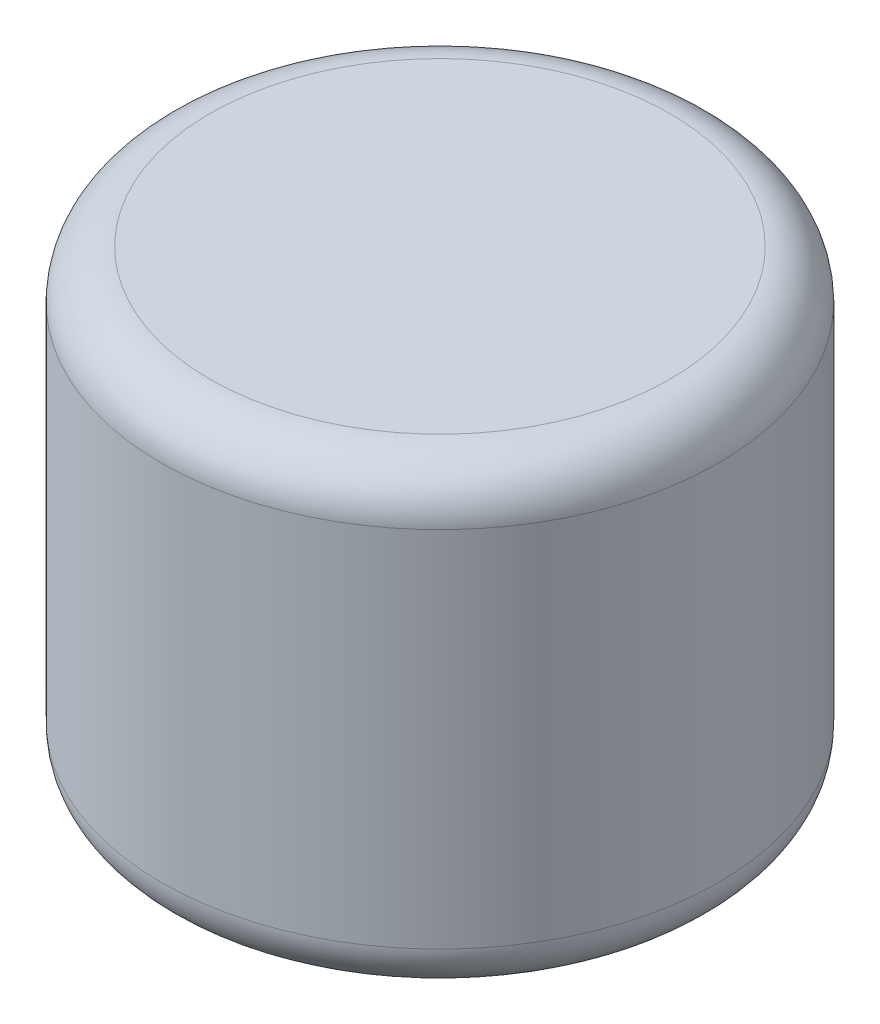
ISO-10303-21;
HEADER;
FILE_DESCRIPTION(('STEP AP214'),'2;1');
FILE_NAME('part.step','',(''),(''),'','','');
FILE_SCHEMA(('AUTOMOTIVE_DESIGN { 1 0 10303 214 1 1 1 1 }'));
ENDSEC;
DATA;
#1=APPLICATION_CONTEXT('core data for automotive mechanical design processes');
#2=APPLICATION_PROTOCOL_DEFINITION('international standard','automotive_design',2000,#1);
#3=PRODUCT_CONTEXT('',#1,'mechanical');
#4=PRODUCT('Part','Part','',(#3));
#5=PRODUCT_RELATED_PRODUCT_CATEGORY('part','',(#4));
#6=PRODUCT_DEFINITION_FORMATION('','',#4);
#7=PRODUCT_DEFINITION_CONTEXT('part definition',#1,'design');
#8=PRODUCT_DEFINITION('design','',#6,#7);
#9=PRODUCT_DEFINITION_SHAPE('','',#8);
#10=(LENGTH_UNIT() NAMED_UNIT(*) SI_UNIT(.MILLI.,.METRE.));
#11=(NAMED_UNIT(*) PLANE_ANGLE_UNIT() SI_UNIT($,.RADIAN.));
#12=(NAMED_UNIT(*) SI_UNIT($,.STERADIAN.) SOLID_ANGLE_UNIT());
#13=UNCERTAINTY_MEASURE_WITH_UNIT(LENGTH_MEASURE(1.E-05),#10,'distance_accuracy_value','');
#14=(GEOMETRIC_REPRESENTATION_CONTEXT(3) GLOBAL_UNCERTAINTY_ASSIGNED_CONTEXT((#13)) GLOBAL_UNIT_ASSIGNED_CONTEXT((#10,
#11,#12)) REPRESENTATION_CONTEXT('',''));
#15=CARTESIAN_POINT('',(0.,0.,0.));
#16=DIRECTION('',(0.,0.,1.));
#17=DIRECTION('',(1.,0.,0.));
#18=AXIS2_PLACEMENT_3D('',#15,#16,#17);
#19=CARTESIAN_POINT('',(0.,19.,0.));
#20=DIRECTION('',(0.,-1.,0.));
#21=DIRECTION('',(0.,0.,-1.));
#22=AXIS2_PLACEMENT_3D('',#19,#20,#21);
#23=CYLINDRICAL_SURFACE('',#22,11.5);
#24=CARTESIAN_POINT('',(0.,2.,0.));
#25=DIRECTION('',(0.,1.,0.));
#26=DIRECTION('',(0.,0.,1.));
#27=AXIS2_PLACEMENT_3D('',#24,#25,#26);
#28=CIRCLE('',#27,11.5);
#29=CARTESIAN_POINT('',(0.,2.,11.5));
#30=VERTEX_POINT('',#29);
#31=EDGE_CURVE('E41',#30,#30,#28,.T.);
#32=ORIENTED_EDGE('',*,*,#31,.T.);
#33=EDGE_LOOP('',(#32));
#34=FACE_BOUND('',#33,.T.);
#35=CARTESIAN_POINT('',(0.,17.,0.));
#36=DIRECTION('',(0.,1.,0.));
#37=DIRECTION('',(0.,0.,1.));
#38=AXIS2_PLACEMENT_3D('',#35,#36,#37);
#39=CIRCLE('',#38,11.5);
#40=CARTESIAN_POINT('',(0.,17.,11.5));
#41=VERTEX_POINT('',#40);
#42=EDGE_CURVE('E45',#41,#41,#39,.F.);
#43=ORIENTED_EDGE('',*,*,#42,.T.);
#44=EDGE_LOOP('',(#43));
#45=FACE_BOUND('',#44,.T.);
#46=ADVANCED_FACE('F30',(#34,#45),#23,.T.);
#47=CARTESIAN_POINT('',(0.,19.,0.));
#48=DIRECTION('',(0.,1.,0.));
#49=DIRECTION('',(0.,0.,1.));
#50=AXIS2_PLACEMENT_3D('',#47,#48,#49);
#51=PLANE('',#50);
#52=CARTESIAN_POINT('',(0.,19.,0.));
#53=DIRECTION('',(0.,1.,0.));
#54=DIRECTION('',(0.,0.,1.));
#55=AXIS2_PLACEMENT_3D('',#52,#53,#54);
#56=CIRCLE('',#55,9.5);
#57=CARTESIAN_POINT('',(0.,19.,9.5));
#58=VERTEX_POINT('',#57);
#59=EDGE_CURVE('E10',#58,#58,#56,.T.);
#60=ORIENTED_EDGE('',*,*,#59,.T.);
#61=EDGE_LOOP('',(#60));
#62=FACE_BOUND('',#61,.T.);
#63=ADVANCED_FACE('F61',(#62),#51,.T.);
#64=CARTESIAN_POINT('',(0.,0.,0.));
#65=DIRECTION('',(0.,1.,0.));
#66=DIRECTION('',(0.,0.,1.));
#67=AXIS2_PLACEMENT_3D('',#64,#65,#66);
#68=PLANE('',#67);
#69=CARTESIAN_POINT('',(0.,0.,0.));
#70=DIRECTION('',(0.,1.,0.));
#71=DIRECTION('',(0.,0.,1.));
#72=AXIS2_PLACEMENT_3D('',#69,#70,#71);
#73=CIRCLE('',#72,9.5);
#74=CARTESIAN_POINT('',(0.,0.,9.5));
#75=VERTEX_POINT('',#74);
#76=EDGE_CURVE('E37',#75,#75,#73,.F.);
#77=ORIENTED_EDGE('',*,*,#76,.T.);
#78=EDGE_LOOP('',(#77));
#79=FACE_BOUND('',#78,.T.);
#80=ADVANCED_FACE('F58',(#79),#68,.F.);
#81=CARTESIAN_POINT('',(0.,2.,0.));
#82=DIRECTION('',(0.,1.,0.));
#83=DIRECTION('',(0.,0.,1.));
#84=AXIS2_PLACEMENT_3D('',#81,#82,#83);
#85=TOROIDAL_SURFACE('',#84,9.5,2.);
#86=ORIENTED_EDGE('',*,*,#76,.F.);
#87=EDGE_LOOP('',(#86));
#88=FACE_BOUND('',#87,.T.);
#89=ORIENTED_EDGE('',*,*,#31,.F.);
#90=EDGE_LOOP('',(#89));
#91=FACE_BOUND('',#90,.T.);
#92=ADVANCED_FACE('F54',(#88,#91),#85,.T.);
#93=CARTESIAN_POINT('',(0.,17.,0.));
#94=DIRECTION('',(0.,1.,0.));
#95=DIRECTION('',(0.,0.,1.));
#96=AXIS2_PLACEMENT_3D('',#93,#94,#95);
#97=TOROIDAL_SURFACE('',#96,9.5,2.);
#98=ORIENTED_EDGE('',*,*,#42,.F.);
#99=EDGE_LOOP('',(#98));
#100=FACE_BOUND('',#99,.T.);
#101=ORIENTED_EDGE('',*,*,#59,.F.);
#102=EDGE_LOOP('',(#101));
#103=FACE_BOUND('',#102,.T.);
#104=ADVANCED_FACE('F32',(#100,#103),#97,.T.);
#105=CLOSED_SHELL('',(#46,#63,#80,#92,#104));
#106=MANIFOLD_SOLID_BREP('B2',#105);
#107=ADVANCED_BREP_SHAPE_REPRESENTATION('',(#18,#106),#14);
#108=SHAPE_DEFINITION_REPRESENTATION(#9,#107);
ENDSEC;
END-ISO-10303-21;
